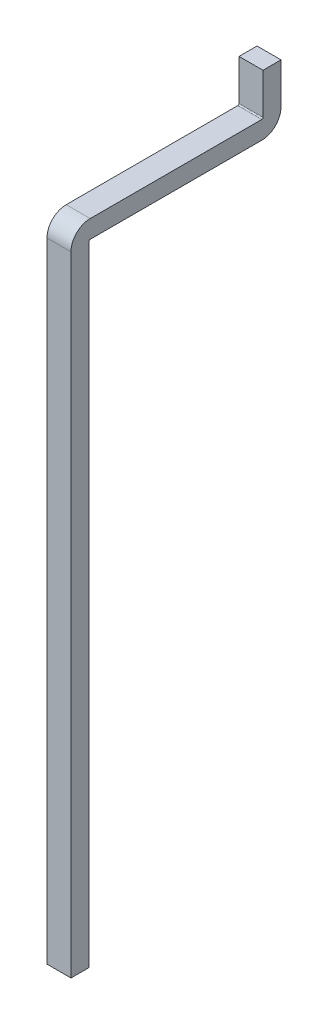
ISO-10303-21;
HEADER;
FILE_DESCRIPTION(('STEP AP214'),'2;1');
FILE_NAME('part.step','',(''),(''),'','','');
FILE_SCHEMA(('AUTOMOTIVE_DESIGN { 1 0 10303 214 1 1 1 1 }'));
ENDSEC;
DATA;
#1=APPLICATION_CONTEXT('core data for automotive mechanical design processes');
#2=APPLICATION_PROTOCOL_DEFINITION('international standard','automotive_design',2000,#1);
#3=PRODUCT_CONTEXT('',#1,'mechanical');
#4=PRODUCT('Part','Part','',(#3));
#5=PRODUCT_RELATED_PRODUCT_CATEGORY('part','',(#4));
#6=PRODUCT_DEFINITION_FORMATION('','',#4);
#7=PRODUCT_DEFINITION_CONTEXT('part definition',#1,'design');
#8=PRODUCT_DEFINITION('design','',#6,#7);
#9=PRODUCT_DEFINITION_SHAPE('','',#8);
#10=(LENGTH_UNIT() NAMED_UNIT(*) SI_UNIT(.MILLI.,.METRE.));
#11=(NAMED_UNIT(*) PLANE_ANGLE_UNIT() SI_UNIT($,.RADIAN.));
#12=(NAMED_UNIT(*) SI_UNIT($,.STERADIAN.) SOLID_ANGLE_UNIT());
#13=UNCERTAINTY_MEASURE_WITH_UNIT(LENGTH_MEASURE(1.E-05),#10,'distance_accuracy_value','');
#14=(GEOMETRIC_REPRESENTATION_CONTEXT(3) GLOBAL_UNCERTAINTY_ASSIGNED_CONTEXT((#13)) GLOBAL_UNIT_ASSIGNED_CONTEXT((#10,
#11,#12)) REPRESENTATION_CONTEXT('',''));
#15=CARTESIAN_POINT('',(0.,0.,0.));
#16=DIRECTION('',(0.,0.,1.));
#17=DIRECTION('',(1.,0.,0.));
#18=AXIS2_PLACEMENT_3D('',#15,#16,#17);
#19=CARTESIAN_POINT('',(0.1,5.41,-1.44));
#20=DIRECTION('',(-1.,0.,0.));
#21=DIRECTION('',(0.,1.,0.));
#22=AXIS2_PLACEMENT_3D('',#19,#20,#21);
#23=CYLINDRICAL_SURFACE('',#22,0.01);
#24=CARTESIAN_POINT('',(-0.1,5.41,-1.44));
#25=DIRECTION('',(-1.,0.,0.));
#26=DIRECTION('',(0.,-1.,0.));
#27=AXIS2_PLACEMENT_3D('',#24,#25,#26);
#28=CIRCLE('',#27,0.01);
#29=CARTESIAN_POINT('',(-0.1,5.41,-1.45));
#30=VERTEX_POINT('',#29);
#31=CARTESIAN_POINT('',(-0.1,5.4,-1.44));
#32=VERTEX_POINT('',#31);
#33=EDGE_CURVE('E183',#30,#32,#28,.T.);
#34=ORIENTED_EDGE('',*,*,#33,.T.);
#35=DIRECTION('',(-1.,0.,0.));
#36=VECTOR('',#35,1.);
#37=CARTESIAN_POINT('',(0.1,5.4,-1.44));
#38=LINE('',#37,#36);
#39=CARTESIAN_POINT('',(0.1,5.4,-1.44));
#40=VERTEX_POINT('',#39);
#41=EDGE_CURVE('E196',#40,#32,#38,.T.);
#42=ORIENTED_EDGE('',*,*,#41,.F.);
#43=CARTESIAN_POINT('',(0.1,5.41,-1.44));
#44=DIRECTION('',(-1.,0.,0.));
#45=DIRECTION('',(0.,-1.,0.));
#46=AXIS2_PLACEMENT_3D('',#43,#44,#45);
#47=CIRCLE('',#46,0.01);
#48=CARTESIAN_POINT('',(0.1,5.41,-1.45));
#49=VERTEX_POINT('',#48);
#50=EDGE_CURVE('E240',#49,#40,#47,.T.);
#51=ORIENTED_EDGE('',*,*,#50,.F.);
#52=DIRECTION('',(-1.,0.,0.));
#53=VECTOR('',#52,1.);
#54=CARTESIAN_POINT('',(0.1,5.41,-1.45));
#55=LINE('',#54,#53);
#56=EDGE_CURVE('E21',#49,#30,#55,.T.);
#57=ORIENTED_EDGE('',*,*,#56,.T.);
#58=EDGE_LOOP('',(#34,#42,#51,#57));
#59=FACE_BOUND('',#58,.T.);
#60=ADVANCED_FACE('F17',(#59),#23,.F.);
#61=CARTESIAN_POINT('',(0.1,5.41,-1.44));
#62=DIRECTION('',(-1.,0.,0.));
#63=DIRECTION('',(0.,1.,0.));
#64=AXIS2_PLACEMENT_3D('',#61,#62,#63);
#65=CYLINDRICAL_SURFACE('',#64,0.16);
#66=CARTESIAN_POINT('',(-0.1,5.41,-1.44));
#67=DIRECTION('',(-1.,0.,0.));
#68=DIRECTION('',(0.,1.,0.));
#69=AXIS2_PLACEMENT_3D('',#66,#67,#68);
#70=CIRCLE('',#69,0.16);
#71=CARTESIAN_POINT('',(-0.1,5.41,-1.6));
#72=VERTEX_POINT('',#71);
#73=CARTESIAN_POINT('',(-0.1,5.25,-1.44));
#74=VERTEX_POINT('',#73);
#75=EDGE_CURVE('E195',#72,#74,#70,.T.);
#76=ORIENTED_EDGE('',*,*,#75,.F.);
#77=DIRECTION('',(-1.,0.,0.));
#78=VECTOR('',#77,1.);
#79=CARTESIAN_POINT('',(0.1,5.41,-1.6));
#80=LINE('',#79,#78);
#81=CARTESIAN_POINT('',(0.1,5.41,-1.6));
#82=VERTEX_POINT('',#81);
#83=EDGE_CURVE('E187',#82,#72,#80,.T.);
#84=ORIENTED_EDGE('',*,*,#83,.F.);
#85=CARTESIAN_POINT('',(0.1,5.41,-1.44));
#86=DIRECTION('',(1.,0.,0.));
#87=DIRECTION('',(0.,1.,0.));
#88=AXIS2_PLACEMENT_3D('',#85,#86,#87);
#89=CIRCLE('',#88,0.16);
#90=CARTESIAN_POINT('',(0.1,5.25,-1.44));
#91=VERTEX_POINT('',#90);
#92=EDGE_CURVE('E214',#91,#82,#89,.T.);
#93=ORIENTED_EDGE('',*,*,#92,.F.);
#94=DIRECTION('',(-1.,0.,0.));
#95=VECTOR('',#94,1.);
#96=CARTESIAN_POINT('',(0.1,5.25,-1.44));
#97=LINE('',#96,#95);
#98=EDGE_CURVE('E191',#91,#74,#97,.T.);
#99=ORIENTED_EDGE('',*,*,#98,.T.);
#100=EDGE_LOOP('',(#76,#84,#93,#99));
#101=FACE_BOUND('',#100,.T.);
#102=ADVANCED_FACE('F385',(#101),#65,.T.);
#103=CARTESIAN_POINT('',(-0.1,5.75,-1.6));
#104=DIRECTION('',(0.,-1.,0.));
#105=DIRECTION('',(0.,0.,-1.));
#106=AXIS2_PLACEMENT_3D('',#103,#104,#105);
#107=PLANE('',#106);
#108=DIRECTION('',(1.,0.,0.));
#109=VECTOR('',#108,1.);
#110=CARTESIAN_POINT('',(-0.1,5.75,-1.45));
#111=LINE('',#110,#109);
#112=CARTESIAN_POINT('',(-0.1,5.75,-1.45));
#113=VERTEX_POINT('',#112);
#114=CARTESIAN_POINT('',(0.1,5.75,-1.45));
#115=VERTEX_POINT('',#114);
#116=EDGE_CURVE('E11',#113,#115,#111,.T.);
#117=ORIENTED_EDGE('',*,*,#116,.T.);
#118=DIRECTION('',(0.,0.,1.));
#119=VECTOR('',#118,1.);
#120=CARTESIAN_POINT('',(0.1,5.75,-1.6));
#121=LINE('',#120,#119);
#122=CARTESIAN_POINT('',(0.1,5.75,-1.6));
#123=VERTEX_POINT('',#122);
#124=EDGE_CURVE('E233',#123,#115,#121,.T.);
#125=ORIENTED_EDGE('',*,*,#124,.F.);
#126=DIRECTION('',(1.,0.,0.));
#127=VECTOR('',#126,1.);
#128=CARTESIAN_POINT('',(-0.1,5.75,-1.6));
#129=LINE('',#128,#127);
#130=CARTESIAN_POINT('',(-0.1,5.75,-1.6));
#131=VERTEX_POINT('',#130);
#132=EDGE_CURVE('E190',#131,#123,#129,.T.);
#133=ORIENTED_EDGE('',*,*,#132,.F.);
#134=DIRECTION('',(0.,0.,1.));
#135=VECTOR('',#134,1.);
#136=CARTESIAN_POINT('',(-0.1,5.75,-1.6));
#137=LINE('',#136,#135);
#138=EDGE_CURVE('E169',#131,#113,#137,.T.);
#139=ORIENTED_EDGE('',*,*,#138,.T.);
#140=EDGE_LOOP('',(#117,#125,#133,#139));
#141=FACE_BOUND('',#140,.T.);
#142=ADVANCED_FACE('F390',(#141),#107,.F.);
#143=CARTESIAN_POINT('',(0.,0.,-1.45));
#144=DIRECTION('',(0.,0.,-1.));
#145=DIRECTION('',(0.,-1.,0.));
#146=AXIS2_PLACEMENT_3D('',#143,#144,#145);
#147=PLANE('',#146);
#148=ORIENTED_EDGE('',*,*,#56,.F.);
#149=DIRECTION('',(0.,-1.,0.));
#150=VECTOR('',#149,1.);
#151=CARTESIAN_POINT('',(0.1,5.363268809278,-1.45));
#152=LINE('',#151,#150);
#153=EDGE_CURVE('E237',#115,#49,#152,.T.);
#154=ORIENTED_EDGE('',*,*,#153,.F.);
#155=ORIENTED_EDGE('',*,*,#116,.F.);
#156=DIRECTION('',(0.,1.,0.));
#157=VECTOR('',#156,1.);
#158=CARTESIAN_POINT('',(-0.1,5.363268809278,-1.45));
#159=LINE('',#158,#157);
#160=EDGE_CURVE('E173',#30,#113,#159,.T.);
#161=ORIENTED_EDGE('',*,*,#160,.F.);
#162=EDGE_LOOP('',(#148,#154,#155,#161));
#163=FACE_BOUND('',#162,.T.);
#164=ADVANCED_FACE('F19',(#163),#147,.F.);
#165=CARTESIAN_POINT('',(0.,0.,-1.6));
#166=DIRECTION('',(0.,0.,-1.));
#167=DIRECTION('',(0.,-1.,0.));
#168=AXIS2_PLACEMENT_3D('',#165,#166,#167);
#169=PLANE('',#168);
#170=DIRECTION('',(0.,-1.,0.));
#171=VECTOR('',#170,1.);
#172=CARTESIAN_POINT('',(0.1,5.363268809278,-1.6));
#173=LINE('',#172,#171);
#174=EDGE_CURVE('E218',#123,#82,#173,.T.);
#175=ORIENTED_EDGE('',*,*,#174,.T.);
#176=ORIENTED_EDGE('',*,*,#83,.T.);
#177=DIRECTION('',(0.,1.,0.));
#178=VECTOR('',#177,1.);
#179=CARTESIAN_POINT('',(-0.1,5.363268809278,-1.6));
#180=LINE('',#179,#178);
#181=EDGE_CURVE('E172',#72,#131,#180,.T.);
#182=ORIENTED_EDGE('',*,*,#181,.T.);
#183=ORIENTED_EDGE('',*,*,#132,.T.);
#184=EDGE_LOOP('',(#175,#176,#182,#183));
#185=FACE_BOUND('',#184,.T.);
#186=ADVANCED_FACE('F480',(#185),#169,.T.);
#187=CARTESIAN_POINT('',(0.1,5.24,-0.01));
#188=DIRECTION('',(-1.,0.,0.));
#189=DIRECTION('',(0.,0.,-1.));
#190=AXIS2_PLACEMENT_3D('',#187,#188,#189);
#191=CYLINDRICAL_SURFACE('',#190,0.01);
#192=DIRECTION('',(-1.,0.,0.));
#193=VECTOR('',#192,1.);
#194=CARTESIAN_POINT('',(0.1,5.24,0.));
#195=LINE('',#194,#193);
#196=CARTESIAN_POINT('',(0.1,5.24,0.));
#197=VERTEX_POINT('',#196);
#198=CARTESIAN_POINT('',(-0.1,5.24,0.));
#199=VERTEX_POINT('',#198);
#200=EDGE_CURVE('E256',#197,#199,#195,.T.);
#201=ORIENTED_EDGE('',*,*,#200,.T.);
#202=CARTESIAN_POINT('',(-0.1,5.24,-0.01));
#203=DIRECTION('',(-1.,0.,0.));
#204=DIRECTION('',(0.,0.,1.));
#205=AXIS2_PLACEMENT_3D('',#202,#203,#204);
#206=CIRCLE('',#205,0.01);
#207=CARTESIAN_POINT('',(-0.1,5.25,-0.01));
#208=VERTEX_POINT('',#207);
#209=EDGE_CURVE('E210',#199,#208,#206,.T.);
#210=ORIENTED_EDGE('',*,*,#209,.T.);
#211=DIRECTION('',(1.,0.,0.));
#212=VECTOR('',#211,1.);
#213=CARTESIAN_POINT('',(-0.1,5.25,-0.01));
#214=LINE('',#213,#212);
#215=CARTESIAN_POINT('',(0.1,5.25,-0.01));
#216=VERTEX_POINT('',#215);
#217=EDGE_CURVE('E199',#208,#216,#214,.T.);
#218=ORIENTED_EDGE('',*,*,#217,.T.);
#219=CARTESIAN_POINT('',(0.1,5.24,-0.01));
#220=DIRECTION('',(-1.,0.,0.));
#221=DIRECTION('',(0.,0.,1.));
#222=AXIS2_PLACEMENT_3D('',#219,#220,#221);
#223=CIRCLE('',#222,0.01);
#224=EDGE_CURVE('E175',#197,#216,#223,.T.);
#225=ORIENTED_EDGE('',*,*,#224,.F.);
#226=EDGE_LOOP('',(#201,#210,#218,#225));
#227=FACE_BOUND('',#226,.T.);
#228=ADVANCED_FACE('F472',(#227),#191,.F.);
#229=CARTESIAN_POINT('',(0.1,5.24,-0.01));
#230=DIRECTION('',(-1.,0.,0.));
#231=DIRECTION('',(0.,0.,-1.));
#232=AXIS2_PLACEMENT_3D('',#229,#230,#231);
#233=CYLINDRICAL_SURFACE('',#232,0.16);
#234=DIRECTION('',(-1.,0.,0.));
#235=VECTOR('',#234,1.);
#236=CARTESIAN_POINT('',(0.1,5.24,0.15));
#237=LINE('',#236,#235);
#238=CARTESIAN_POINT('',(0.1,5.24,0.15));
#239=VERTEX_POINT('',#238);
#240=CARTESIAN_POINT('',(-0.1,5.24,0.15));
#241=VERTEX_POINT('',#240);
#242=EDGE_CURVE('E48',#239,#241,#237,.T.);
#243=ORIENTED_EDGE('',*,*,#242,.F.);
#244=CARTESIAN_POINT('',(0.1,5.24,-0.01));
#245=DIRECTION('',(-1.,0.,0.));
#246=DIRECTION('',(0.,0.,-1.));
#247=AXIS2_PLACEMENT_3D('',#244,#245,#246);
#248=CIRCLE('',#247,0.16);
#249=CARTESIAN_POINT('',(0.1,5.4,-0.01));
#250=VERTEX_POINT('',#249);
#251=EDGE_CURVE('E249',#239,#250,#248,.T.);
#252=ORIENTED_EDGE('',*,*,#251,.T.);
#253=DIRECTION('',(1.,0.,0.));
#254=VECTOR('',#253,1.);
#255=CARTESIAN_POINT('',(-0.1,5.4,-0.01));
#256=LINE('',#255,#254);
#257=CARTESIAN_POINT('',(-0.1,5.4,-0.01));
#258=VERTEX_POINT('',#257);
#259=EDGE_CURVE('E146',#258,#250,#256,.T.);
#260=ORIENTED_EDGE('',*,*,#259,.F.);
#261=CARTESIAN_POINT('',(-0.1,5.24,-0.01));
#262=DIRECTION('',(1.,0.,0.));
#263=DIRECTION('',(0.,0.,-1.));
#264=AXIS2_PLACEMENT_3D('',#261,#262,#263);
#265=CIRCLE('',#264,0.16);
#266=EDGE_CURVE('E144',#258,#241,#265,.T.);
#267=ORIENTED_EDGE('',*,*,#266,.T.);
#268=EDGE_LOOP('',(#243,#252,#260,#267));
#269=FACE_BOUND('',#268,.T.);
#270=ADVANCED_FACE('F145',(#269),#233,.T.);
#271=CARTESIAN_POINT('',(0.,5.25,0.));
#272=DIRECTION('',(0.,1.,0.));
#273=DIRECTION('',(0.,0.,-1.));
#274=AXIS2_PLACEMENT_3D('',#271,#272,#273);
#275=PLANE('',#274);
#276=ORIENTED_EDGE('',*,*,#217,.F.);
#277=DIRECTION('',(0.,0.,1.));
#278=VECTOR('',#277,1.);
#279=CARTESIAN_POINT('',(-0.1,5.25,0.03673119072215));
#280=LINE('',#279,#278);
#281=EDGE_CURVE('E206',#74,#208,#280,.T.);
#282=ORIENTED_EDGE('',*,*,#281,.F.);
#283=ORIENTED_EDGE('',*,*,#98,.F.);
#284=DIRECTION('',(0.,0.,-1.));
#285=VECTOR('',#284,1.);
#286=CARTESIAN_POINT('',(0.1,5.25,0.03673119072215));
#287=LINE('',#286,#285);
#288=EDGE_CURVE('E179',#216,#91,#287,.T.);
#289=ORIENTED_EDGE('',*,*,#288,.F.);
#290=EDGE_LOOP('',(#276,#282,#283,#289));
#291=FACE_BOUND('',#290,.T.);
#292=ADVANCED_FACE('F456',(#291),#275,.F.);
#293=CARTESIAN_POINT('',(0.,5.4,0.));
#294=DIRECTION('',(0.,1.,0.));
#295=DIRECTION('',(0.,0.,-1.));
#296=AXIS2_PLACEMENT_3D('',#293,#294,#295);
#297=PLANE('',#296);
#298=DIRECTION('',(0.,0.,1.));
#299=VECTOR('',#298,1.);
#300=CARTESIAN_POINT('',(-0.1,5.4,0.03673119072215));
#301=LINE('',#300,#299);
#302=EDGE_CURVE('E151',#32,#258,#301,.T.);
#303=ORIENTED_EDGE('',*,*,#302,.T.);
#304=ORIENTED_EDGE('',*,*,#259,.T.);
#305=DIRECTION('',(0.,0.,-1.));
#306=VECTOR('',#305,1.);
#307=CARTESIAN_POINT('',(0.1,5.4,0.03673119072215));
#308=LINE('',#307,#306);
#309=EDGE_CURVE('E245',#250,#40,#308,.T.);
#310=ORIENTED_EDGE('',*,*,#309,.T.);
#311=ORIENTED_EDGE('',*,*,#41,.T.);
#312=EDGE_LOOP('',(#303,#304,#310,#311));
#313=FACE_BOUND('',#312,.T.);
#314=ADVANCED_FACE('F441',(#313),#297,.T.);
#315=CARTESIAN_POINT('',(0.,0.,0.));
#316=DIRECTION('',(0.,0.,1.));
#317=DIRECTION('',(1.,0.,0.));
#318=AXIS2_PLACEMENT_3D('',#315,#316,#317);
#319=PLANE('',#318);
#320=ORIENTED_EDGE('',*,*,#200,.F.);
#321=DIRECTION('',(0.,1.,0.));
#322=VECTOR('',#321,1.);
#323=CARTESIAN_POINT('',(0.1,0.,0.));
#324=LINE('',#323,#322);
#325=CARTESIAN_POINT('',(0.1,0.,0.));
#326=VERTEX_POINT('',#325);
#327=EDGE_CURVE('E167',#326,#197,#324,.T.);
#328=ORIENTED_EDGE('',*,*,#327,.F.);
#329=DIRECTION('',(1.,0.,0.));
#330=VECTOR('',#329,1.);
#331=CARTESIAN_POINT('',(-0.1,0.,0.));
#332=LINE('',#331,#330);
#333=CARTESIAN_POINT('',(-0.1,0.,0.));
#334=VERTEX_POINT('',#333);
#335=EDGE_CURVE('E202',#334,#326,#332,.T.);
#336=ORIENTED_EDGE('',*,*,#335,.F.);
#337=DIRECTION('',(0.,-1.,0.));
#338=VECTOR('',#337,1.);
#339=CARTESIAN_POINT('',(-0.1,5.4,0.));
#340=LINE('',#339,#338);
#341=EDGE_CURVE('E168',#199,#334,#340,.T.);
#342=ORIENTED_EDGE('',*,*,#341,.F.);
#343=EDGE_LOOP('',(#320,#328,#336,#342));
#344=FACE_BOUND('',#343,.T.);
#345=ADVANCED_FACE('F432',(#344),#319,.F.);
#346=CARTESIAN_POINT('',(-0.1,0.,0.15));
#347=DIRECTION('',(0.,1.,0.));
#348=DIRECTION('',(1.,0.,0.));
#349=AXIS2_PLACEMENT_3D('',#346,#347,#348);
#350=PLANE('',#349);
#351=ORIENTED_EDGE('',*,*,#335,.T.);
#352=DIRECTION('',(0.,0.,-1.));
#353=VECTOR('',#352,1.);
#354=CARTESIAN_POINT('',(0.1,0.,0.15));
#355=LINE('',#354,#353);
#356=CARTESIAN_POINT('',(0.1,0.,0.15));
#357=VERTEX_POINT('',#356);
#358=EDGE_CURVE('E141',#357,#326,#355,.T.);
#359=ORIENTED_EDGE('',*,*,#358,.F.);
#360=DIRECTION('',(1.,0.,0.));
#361=VECTOR('',#360,1.);
#362=CARTESIAN_POINT('',(-0.1,0.,0.15));
#363=LINE('',#362,#361);
#364=CARTESIAN_POINT('',(-0.1,0.,0.15));
#365=VERTEX_POINT('',#364);
#366=EDGE_CURVE('E38',#365,#357,#363,.T.);
#367=ORIENTED_EDGE('',*,*,#366,.F.);
#368=DIRECTION('',(0.,0.,-1.));
#369=VECTOR('',#368,1.);
#370=CARTESIAN_POINT('',(-0.1,0.,0.15));
#371=LINE('',#370,#369);
#372=EDGE_CURVE('E157',#365,#334,#371,.T.);
#373=ORIENTED_EDGE('',*,*,#372,.T.);
#374=EDGE_LOOP('',(#351,#359,#367,#373));
#375=FACE_BOUND('',#374,.T.);
#376=ADVANCED_FACE('F417',(#375),#350,.F.);
#377=CARTESIAN_POINT('',(0.,0.,0.15));
#378=DIRECTION('',(0.,0.,1.));
#379=DIRECTION('',(1.,0.,0.));
#380=AXIS2_PLACEMENT_3D('',#377,#378,#379);
#381=PLANE('',#380);
#382=DIRECTION('',(0.,1.,0.));
#383=VECTOR('',#382,1.);
#384=CARTESIAN_POINT('',(0.1,0.,0.15));
#385=LINE('',#384,#383);
#386=EDGE_CURVE('E138',#357,#239,#385,.T.);
#387=ORIENTED_EDGE('',*,*,#386,.T.);
#388=ORIENTED_EDGE('',*,*,#242,.T.);
#389=DIRECTION('',(0.,-1.,0.));
#390=VECTOR('',#389,1.);
#391=CARTESIAN_POINT('',(-0.1,5.4,0.15));
#392=LINE('',#391,#390);
#393=EDGE_CURVE('E136',#241,#365,#392,.T.);
#394=ORIENTED_EDGE('',*,*,#393,.T.);
#395=ORIENTED_EDGE('',*,*,#366,.T.);
#396=EDGE_LOOP('',(#387,#388,#394,#395));
#397=FACE_BOUND('',#396,.T.);
#398=ADVANCED_FACE('F134',(#397),#381,.T.);
#399=CARTESIAN_POINT('',(0.1,0.,0.15));
#400=DIRECTION('',(-1.,0.,0.));
#401=DIRECTION('',(0.,0.,1.));
#402=AXIS2_PLACEMENT_3D('',#399,#400,#401);
#403=PLANE('',#402);
#404=ORIENTED_EDGE('',*,*,#327,.T.);
#405=ORIENTED_EDGE('',*,*,#224,.T.);
#406=ORIENTED_EDGE('',*,*,#288,.T.);
#407=ORIENTED_EDGE('',*,*,#92,.T.);
#408=ORIENTED_EDGE('',*,*,#174,.F.);
#409=ORIENTED_EDGE('',*,*,#124,.T.);
#410=ORIENTED_EDGE('',*,*,#153,.T.);
#411=ORIENTED_EDGE('',*,*,#50,.T.);
#412=ORIENTED_EDGE('',*,*,#309,.F.);
#413=ORIENTED_EDGE('',*,*,#251,.F.);
#414=ORIENTED_EDGE('',*,*,#386,.F.);
#415=ORIENTED_EDGE('',*,*,#358,.T.);
#416=EDGE_LOOP('',(#404,#405,#406,#407,#408,#409,#410,#411,#412,#413,#414,#415));
#417=FACE_BOUND('',#416,.T.);
#418=ADVANCED_FACE('F408',(#417),#403,.F.);
#419=CARTESIAN_POINT('',(-0.1,5.4,0.15));
#420=DIRECTION('',(1.,0.,0.));
#421=DIRECTION('',(0.,1.,0.));
#422=AXIS2_PLACEMENT_3D('',#419,#420,#421);
#423=PLANE('',#422);
#424=ORIENTED_EDGE('',*,*,#393,.F.);
#425=ORIENTED_EDGE('',*,*,#266,.F.);
#426=ORIENTED_EDGE('',*,*,#302,.F.);
#427=ORIENTED_EDGE('',*,*,#33,.F.);
#428=ORIENTED_EDGE('',*,*,#160,.T.);
#429=ORIENTED_EDGE('',*,*,#138,.F.);
#430=ORIENTED_EDGE('',*,*,#181,.F.);
#431=ORIENTED_EDGE('',*,*,#75,.T.);
#432=ORIENTED_EDGE('',*,*,#281,.T.);
#433=ORIENTED_EDGE('',*,*,#209,.F.);
#434=ORIENTED_EDGE('',*,*,#341,.T.);
#435=ORIENTED_EDGE('',*,*,#372,.F.);
#436=EDGE_LOOP('',(#424,#425,#426,#427,#428,#429,#430,#431,#432,#433,#434,#435));
#437=FACE_BOUND('',#436,.T.);
#438=ADVANCED_FACE('F154',(#437),#423,.F.);
#439=CLOSED_SHELL('',(#60,#102,#142,#164,#186,#228,#270,#292,#314,#345,#376,#398,#418,#438));
#440=MANIFOLD_SOLID_BREP('B1',#439);
#441=ADVANCED_BREP_SHAPE_REPRESENTATION('',(#18,#440),#14);
#442=SHAPE_DEFINITION_REPRESENTATION(#9,#441);
ENDSEC;
END-ISO-10303-21;
